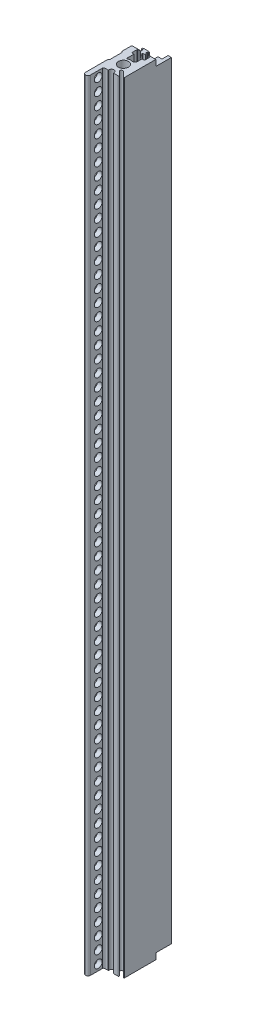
from build123d import *

# Parameters (mm, degrees)
SKETCH_1_R          = 1.6
EXTRUDE_1_DEPTH     = 162.56
SKETCH_7_W          = 5.4
SKETCH_7_H          = 2.5
SKETCH_7_H_2        = 1.2
CUT_EXTRUDE_6_DEPTH = 326.504246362
FILLET_1_R          = 0.2
SKETCH_2_R          = 2.1
CUT_EXTRUDE_1_DEPTH = 10
CUT_EXTRUDE_START   = -10
SKETCH_3_R          = 2.1
CUT_EXTRUDE_2_DEPTH = 10
SKETCH_4_R          = 1.65
CUT_EXTRUDE_3_DEPTH = 12
SKETCH_5_W          = 6.5
SKETCH_5_H          = 2.54
CUT_EXTRUDE_4_DEPTH = 10


with BuildPart() as part:
    # Sketch 1 → Extrude 1 (new, symmetric)
    with BuildSketch(Plane(origin=(0, 0, 0), x_dir=(1, 0, 0), z_dir=(0, 1, 0))):
        with BuildLine():
            Line((-4.20000049, 11.89999994), (-3.89999944, 11.899999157))
            ThreePointArc((-3.89999944, 11.899999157), (-3.758578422, 11.841420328), (-3.699999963, 11.699999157))
            Line((-3.699999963, 11.699999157), (-3.699999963, 9.94999994))
            ThreePointArc((-3.699999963, 9.94999994), (-3.758578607, 9.808578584), (-3.899999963, 9.74999994))
            Line((-3.899999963, 9.74999994), (-4.25, 9.74999994))
            ThreePointArc((-4.25, 9.74999994), (-4.391421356, 9.691421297), (-4.45, 9.54999994))
            Line((-4.45, 9.54999994), (-4.45, 8.5))
            Line((-4.45, 8.5), (-4.7, 8.5))
            Line((-4.7, 8.5), (-5, 8.2))
            Line((-5, 8.2), (-5, 7.4))
            Line((-5, 7.4), (-5, 4.4))
            Line((-5, 4.4), (-4.549867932, 3.899804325))
            Line((-4.549867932, 3.899804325), (-4.550132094, -1.100195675))
            Line((-4.550132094, -1.100195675), (-5, -1.6))
            Line((-5, -1.6), (-5, -10.75))
            ThreePointArc((-5, -10.75), (-4, -11.75), (-3, -10.75))
            Line((-3, -10.75), (-3, -5.75))
            ThreePointArc((-3, -5.75), (-2.853553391, -5.396446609), (-2.5, -5.25))
            Line((-2.5, -5.25), (-1.15000013, -5.25))
            ThreePointArc((-1.15000013, -5.25), (-1.079289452, -5.220710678), (-1.05000013, -5.15))
            Line((-1.05000013, -5.15), (-1.05000013, -5))
            ThreePointArc((-1.05000013, -5), (-1.3e-07, -3.95), (1.04999987, -5))
            Line((1.04999987, -5), (1.04999987, -5.15))
            ThreePointArc((1.04999987, -5.15), (1.079289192, -5.220710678), (1.14999987, -5.25))
            Line((1.14999987, -5.25), (3.070348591, -5.25))
            ThreePointArc((3.070348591, -5.25), (3.255124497, -5.126536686), (3.211769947, -4.908578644))
            Line((3.211769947, -4.908578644), (1.688730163, -3.385538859))
            ThreePointArc((1.688730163, -3.385538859), (1.688730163, -2.537010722), (2.5372583, -2.537010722))
            Line((2.5372583, -2.537010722), (4.658578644, -4.658331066))
            ThreePointArc((4.658578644, -4.658331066), (4.876536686, -4.701685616), (5, -4.516909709))
            Line((5, -4.516909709), (5, -2.080961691))
            Line((5, -2.080961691), (5, 5.179349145))
            Line((5, 5.179349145), (5, 15))
            Line((5, 15), (3.59999987, 15))
            Line((3.59999987, 15), (3.59999987, 12.5))
            Line((3.59999987, 12.5), (1.94999987, 12.5))
            Line((1.94999987, 12.5), (1.94999987, 10.55))
            Line((1.94999987, 10.55), (2.84999987, 10.55))
            Line((2.84999987, 10.55), (2.84999987, 9.35))
            Line((2.84999987, 9.35), (1.94999987, 9.35))
            Line((1.94999987, 9.35), (1.94999987, 8.35))
            Line((1.94999987, 8.35), (2.84999987, 8.35))
            Line((2.84999987, 8.35), (2.84999987, 6.05))
            Line((2.84999987, 6.05), (1.94999987, 6.05))
            Line((1.94999987, 6.05), (1.94999987, 3.885550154))
            ThreePointArc((1.94999987, 3.885550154), (1.567454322, 3.098943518), (0.71249987, 2.914162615))
            ThreePointArc((0.71249987, 2.914162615), (-0.242015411, 2.990222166), (-1.17187513, 2.761649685))
            ThreePointArc((-1.17187513, 2.761649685), (-1.360397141, 2.778988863), (-1.45000013, 2.945759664))
            Line((-1.45000013, 2.945759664), (-1.45000013, 6.05))
            Line((-1.45000013, 6.05), (-2.35000013, 6.05))
            Line((-2.35000013, 6.05), (-2.35000013, 8.35))
            Line((-2.35000013, 8.35), (-1.45000013, 8.35))
            Line((-1.45000013, 8.35), (-1.45000013, 9.35))
            Line((-1.45000013, 9.35), (-2.35000013, 9.35))
            Line((-2.35000013, 9.35), (-2.35000013, 10.55))
            Line((-2.35000013, 10.55), (-1.300000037, 10.55))
            Line((-1.300000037, 10.55), (-1.300000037, 10.617157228))
            ThreePointArc((-1.300000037, 10.617157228), (-1.315224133, 10.693693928), (-1.358578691, 10.758578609))
            Line((-1.358578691, 10.758578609), (-1.941421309, 11.341421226))
            ThreePointArc((-1.941421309, 11.341421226), (-1.984775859, 11.406305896), (-1.999999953, 11.482842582))
            Line((-1.999999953, 11.482842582), (-1.999999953, 11.699999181))
            ThreePointArc((-1.999999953, 11.699999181), (-1.941421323, 11.841420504), (-1.8, 11.899999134))
            Line((-1.8, 11.899999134), (-1.7, 11.899999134))
            ThreePointArc((-1.7, 11.899999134), (-1.558578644, 11.958577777), (-1.5, 12.099999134))
            Line((-1.5, 12.099999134), (-1.5, 12.199999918))
            ThreePointArc((-1.5, 12.199999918), (-1.558578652, 12.341421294), (-1.700000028, 12.399999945))
            Line((-1.700000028, 12.399999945), (-1.867157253, 12.399999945))
            ThreePointArc((-1.867157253, 12.399999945), (-1.943693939, 12.415224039), (-2.008578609, 12.458578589))
            Line((-2.008578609, 12.458578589), (-2.050000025, 12.500000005))
            Line((-2.050000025, 12.500000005), (-3.849999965, 12.500000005))
            Line((-3.849999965, 12.500000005), (-3.891421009, 12.458578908))
            ThreePointArc((-3.891421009, 12.458578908), (-3.95630571, 12.415224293), (-4.032842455, 12.400000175))
            Line((-4.032842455, 12.400000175), (-4.199999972, 12.400000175))
            ThreePointArc((-4.199999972, 12.400000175), (-4.341421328, 12.341421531), (-4.399999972, 12.200000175))
            Line((-4.399999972, 12.200000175), (-4.399999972, 12.099999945))
            ThreePointArc((-4.399999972, 12.099999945), (-4.341421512, 11.95857877), (-4.20000049, 11.89999994))
        make_face()
        with Locations(Location((-1.3e-07, 0, 0), (0, 0, 270))):
            Circle(SKETCH_1_R, mode=Mode.SUBTRACT)
    extrude(amount=EXTRUDE_1_DEPTH, both=True)

    # Sketch 7 → Cut-Extrude 6 (cut, through all)
    with BuildSketch(Plane(origin=(0, 162.56, 0), x_dir=(1, 0, 0), z_dir=(0, 1, 0))):
        with Locations((0.24999987, 7.1)):
            Rectangle(SKETCH_7_W, SKETCH_7_H)
        with Locations((0.24999987, 9.95)):
            Rectangle(SKETCH_7_W, SKETCH_7_H_2)
    extrude(amount=-CUT_EXTRUDE_6_DEPTH, mode=Mode.SUBTRACT)

    # Fillet 1
    fillet_1_edges = [part.edges().sort_by_distance(p)[0] for p in [
        (2.94999987, 0, -5.85),
        (-2.45000013, 0, -8.35),
        (2.94999987, 0, -8.35),
        (-2.45000013, 0, -5.85),
        (2.94999987, 0, -9.35),
        (-2.45000013, 0, -10.55),
        (2.94999987, 0, -10.55),
        (-2.45000013, 0, -9.35),
    ]]
    fillet(fillet_1_edges, radius=FILLET_1_R)

    # Sketch 2 → Cut-Extrude 1 (cut)
    with BuildSketch(Plane(origin=(0, 162.56, 0), x_dir=(1, 0, 0), z_dir=(0, 1, 0))):
        with Locations(Location((0, 0, 0), (0, 0, 270))):
            Circle(SKETCH_2_R)
    extrude(amount=-CUT_EXTRUDE_1_DEPTH, mode=Mode.SUBTRACT)

    # Sketch 3 → Cut-Extrude 2 (cut)
    with BuildSketch(Plane.XZ.offset(162.56).offset(CUT_EXTRUDE_START)):
        with Locations(Location((0, 0, 0), (0, 0, 90))):
            Circle(SKETCH_3_R)
    extrude(amount=CUT_EXTRUDE_2_DEPTH, mode=Mode.SUBTRACT)

    # Sketch 4 → Cut-Extrude 3 (cut)
    with BuildSketch(Plane.ZY.offset(5)):
        with Locations((7.5, -160.02)):
            Circle(SKETCH_4_R)
        with Locations((7.5, -154.94)):
            Circle(SKETCH_4_R)
        with Locations((7.5, -149.86)):
            Circle(SKETCH_4_R)
        with Locations((7.5, -144.78)):
            Circle(SKETCH_4_R)
        with Locations((7.5, -139.7)):
            Circle(SKETCH_4_R)
        with Locations((7.5, -134.62)):
            Circle(SKETCH_4_R)
        with Locations((7.5, -129.54)):
            Circle(SKETCH_4_R)
        with Locations((7.5, -124.46)):
            Circle(SKETCH_4_R)
        with Locations((7.5, -119.38)):
            Circle(SKETCH_4_R)
        with Locations((7.5, -114.3)):
            Circle(SKETCH_4_R)
        with Locations((7.5, -109.22)):
            Circle(SKETCH_4_R)
        with Locations((7.5, -104.14)):
            Circle(SKETCH_4_R)
        with Locations((7.5, -99.06)):
            Circle(SKETCH_4_R)
        with Locations((7.5, -93.98)):
            Circle(SKETCH_4_R)
        with Locations((7.5, -88.9)):
            Circle(SKETCH_4_R)
        with Locations((7.5, -83.82)):
            Circle(SKETCH_4_R)
        with Locations((7.5, -78.74)):
            Circle(SKETCH_4_R)
        with Locations((7.5, -73.66)):
            Circle(SKETCH_4_R)
        with Locations((7.5, -68.58)):
            Circle(SKETCH_4_R)
        with Locations((7.5, -63.5)):
            Circle(SKETCH_4_R)
        with Locations((7.5, -58.42)):
            Circle(SKETCH_4_R)
        with Locations((7.5, -53.34)):
            Circle(SKETCH_4_R)
        with Locations((7.5, -48.26)):
            Circle(SKETCH_4_R)
        with Locations((7.5, -43.18)):
            Circle(SKETCH_4_R)
        with Locations((7.5, -38.1)):
            Circle(SKETCH_4_R)
        with Locations((7.5, -33.02)):
            Circle(SKETCH_4_R)
        with Locations((7.5, -27.94)):
            Circle(SKETCH_4_R)
        with Locations((7.5, -22.86)):
            Circle(SKETCH_4_R)
        with Locations((7.5, -17.78)):
            Circle(SKETCH_4_R)
        with Locations((7.5, -12.7)):
            Circle(SKETCH_4_R)
        with Locations((7.5, -7.62)):
            Circle(SKETCH_4_R)
        with Locations((7.5, -2.54)):
            Circle(SKETCH_4_R)
        with Locations((7.5, 2.54)):
            Circle(SKETCH_4_R)
        with Locations((7.5, 7.62)):
            Circle(SKETCH_4_R)
        with Locations((7.5, 12.7)):
            Circle(SKETCH_4_R)
        with Locations((7.5, 17.78)):
            Circle(SKETCH_4_R)
        with Locations((7.5, 22.86)):
            Circle(SKETCH_4_R)
        with Locations((7.5, 27.94)):
            Circle(SKETCH_4_R)
        with Locations((7.5, 33.02)):
            Circle(SKETCH_4_R)
        with Locations((7.5, 38.1)):
            Circle(SKETCH_4_R)
        with Locations((7.5, 43.18)):
            Circle(SKETCH_4_R)
        with Locations((7.5, 48.26)):
            Circle(SKETCH_4_R)
        with Locations((7.5, 53.34)):
            Circle(SKETCH_4_R)
        with Locations((7.5, 58.42)):
            Circle(SKETCH_4_R)
        with Locations((7.5, 63.5)):
            Circle(SKETCH_4_R)
        with Locations((7.5, 68.58)):
            Circle(SKETCH_4_R)
        with Locations((7.5, 73.66)):
            Circle(SKETCH_4_R)
        with Locations((7.5, 78.74)):
            Circle(SKETCH_4_R)
        with Locations((7.5, 83.82)):
            Circle(SKETCH_4_R)
        with Locations((7.5, 88.9)):
            Circle(SKETCH_4_R)
        with Locations((7.5, 93.98)):
            Circle(SKETCH_4_R)
        with Locations((7.5, 99.06)):
            Circle(SKETCH_4_R)
        with Locations((7.5, 104.14)):
            Circle(SKETCH_4_R)
        with Locations((7.5, 109.22)):
            Circle(SKETCH_4_R)
        with Locations((7.5, 114.3)):
            Circle(SKETCH_4_R)
        with Locations((7.5, 119.38)):
            Circle(SKETCH_4_R)
        with Locations((7.5, 124.46)):
            Circle(SKETCH_4_R)
        with Locations((7.5, 129.54)):
            Circle(SKETCH_4_R)
        with Locations((7.5, 134.62)):
            Circle(SKETCH_4_R)
        with Locations((7.5, 139.7)):
            Circle(SKETCH_4_R)
        with Locations((7.5, 144.78)):
            Circle(SKETCH_4_R)
        with Locations((7.5, 149.86)):
            Circle(SKETCH_4_R)
        with Locations((7.5, 154.94)):
            Circle(SKETCH_4_R)
        with Locations((7.5, 160.02)):
            Circle(SKETCH_4_R)
        with Locations((7.5, 165.1)):
            Circle(SKETCH_4_R)
        with Locations((7.5, 170.18)):
            Circle(SKETCH_4_R)
        with Locations((7.5, 175.26)):
            Circle(SKETCH_4_R)
        with Locations((7.5, 180.34)):
            Circle(SKETCH_4_R)
        with Locations((7.5, 185.42)):
            Circle(SKETCH_4_R)
        with Locations((7.5, 190.5)):
            Circle(SKETCH_4_R)
        with Locations((7.5, 195.58)):
            Circle(SKETCH_4_R)
        with Locations((7.5, 200.66)):
            Circle(SKETCH_4_R)
        with Locations((7.5, 205.74)):
            Circle(SKETCH_4_R)
        with Locations((7.5, 210.82)):
            Circle(SKETCH_4_R)
        with Locations((7.5, 215.9)):
            Circle(SKETCH_4_R)
        with Locations((7.5, 220.98)):
            Circle(SKETCH_4_R)
        with Locations((7.5, 226.06)):
            Circle(SKETCH_4_R)
        with Locations((7.5, 231.14)):
            Circle(SKETCH_4_R)
        with Locations((7.5, 236.22)):
            Circle(SKETCH_4_R)
        with Locations((7.5, 241.3)):
            Circle(SKETCH_4_R)
        with Locations((7.5, 246.38)):
            Circle(SKETCH_4_R)
        with Locations((7.5, 251.46)):
            Circle(SKETCH_4_R)
        with Locations((7.5, 256.54)):
            Circle(SKETCH_4_R)
        with Locations((7.5, 261.62)):
            Circle(SKETCH_4_R)
        with Locations((7.5, 266.7)):
            Circle(SKETCH_4_R)
    extrude(amount=-CUT_EXTRUDE_3_DEPTH, mode=Mode.SUBTRACT)

    # Sketch 5 → Cut-Extrude 4 (cut)
    with BuildSketch(Plane(origin=(5, 0, 0), x_dir=(0, 0, -1), z_dir=(1, 0, 0))):
        with Locations((11.75, 161.29)):
            Rectangle(SKETCH_5_W, SKETCH_5_H)
        with Locations((11.75, -161.29)):
            Rectangle(SKETCH_5_W, SKETCH_5_H)
    extrude(amount=-CUT_EXTRUDE_4_DEPTH, mode=Mode.SUBTRACT)


solid = part.part
